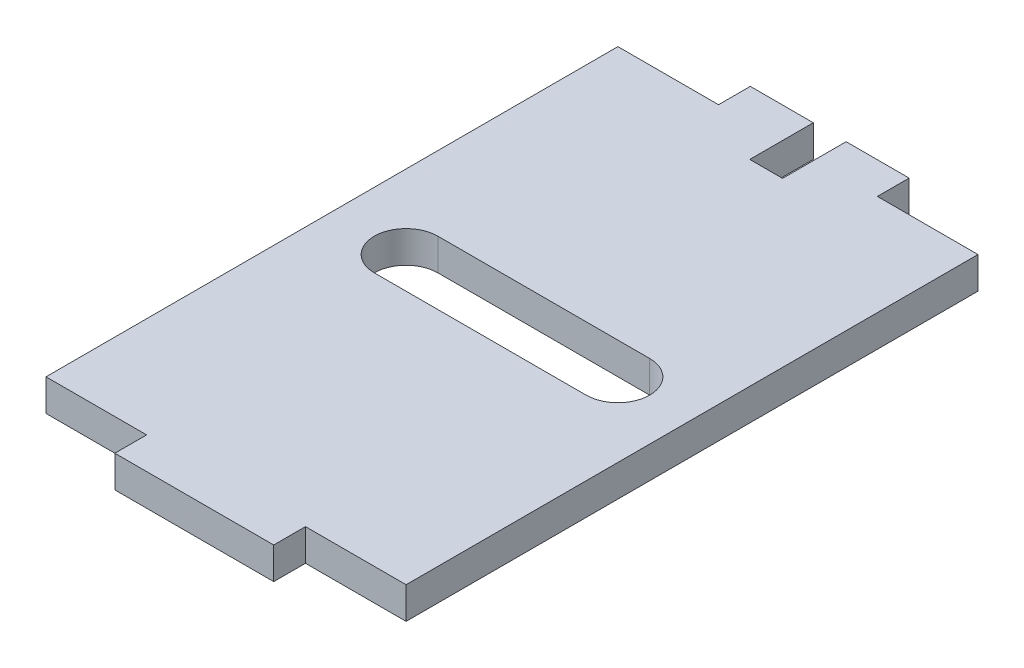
ISO-10303-21;
HEADER;
FILE_DESCRIPTION(('STEP AP214'),'2;1');
FILE_NAME('part.step','',(''),(''),'','','');
FILE_SCHEMA(('AUTOMOTIVE_DESIGN { 1 0 10303 214 1 1 1 1 }'));
ENDSEC;
DATA;
#1=APPLICATION_CONTEXT('core data for automotive mechanical design processes');
#2=APPLICATION_PROTOCOL_DEFINITION('international standard','automotive_design',2000,#1);
#3=PRODUCT_CONTEXT('',#1,'mechanical');
#4=PRODUCT('Part','Part','',(#3));
#5=PRODUCT_RELATED_PRODUCT_CATEGORY('part','',(#4));
#6=PRODUCT_DEFINITION_FORMATION('','',#4);
#7=PRODUCT_DEFINITION_CONTEXT('part definition',#1,'design');
#8=PRODUCT_DEFINITION('design','',#6,#7);
#9=PRODUCT_DEFINITION_SHAPE('','',#8);
#10=(LENGTH_UNIT() NAMED_UNIT(*) SI_UNIT(.MILLI.,.METRE.));
#11=(NAMED_UNIT(*) PLANE_ANGLE_UNIT() SI_UNIT($,.RADIAN.));
#12=(NAMED_UNIT(*) SI_UNIT($,.STERADIAN.) SOLID_ANGLE_UNIT());
#13=UNCERTAINTY_MEASURE_WITH_UNIT(LENGTH_MEASURE(1.E-05),#10,'distance_accuracy_value','');
#14=(GEOMETRIC_REPRESENTATION_CONTEXT(3) GLOBAL_UNCERTAINTY_ASSIGNED_CONTEXT((#13)) GLOBAL_UNIT_ASSIGNED_CONTEXT((#10,
#11,#12)) REPRESENTATION_CONTEXT('',''));
#15=CARTESIAN_POINT('',(0.,0.,0.));
#16=DIRECTION('',(0.,0.,1.));
#17=DIRECTION('',(1.,0.,0.));
#18=AXIS2_PLACEMENT_3D('',#15,#16,#17);
#19=CARTESIAN_POINT('',(17.,3.,27.));
#20=DIRECTION('',(0.,1.,0.));
#21=DIRECTION('',(0.,0.,1.));
#22=AXIS2_PLACEMENT_3D('',#19,#20,#21);
#23=PLANE('',#22);
#24=DIRECTION('',(1.,0.,0.));
#25=VECTOR('',#24,1.);
#26=CARTESIAN_POINT('',(-10.,3.,3.));
#27=LINE('',#26,#25);
#28=CARTESIAN_POINT('',(-10.,3.,3.));
#29=VERTEX_POINT('',#28);
#30=CARTESIAN_POINT('',(10.,3.,3.));
#31=VERTEX_POINT('',#30);
#32=EDGE_CURVE('E458',#29,#31,#27,.T.);
#33=ORIENTED_EDGE('',*,*,#32,.F.);
#34=CARTESIAN_POINT('',(-10.,3.,0.));
#35=DIRECTION('',(0.,1.,0.));
#36=DIRECTION('',(0.,0.,1.));
#37=AXIS2_PLACEMENT_3D('',#34,#35,#36);
#38=CIRCLE('',#37,3.);
#39=CARTESIAN_POINT('',(-10.,3.,-3.));
#40=VERTEX_POINT('',#39);
#41=EDGE_CURVE('E456',#40,#29,#38,.T.);
#42=ORIENTED_EDGE('',*,*,#41,.F.);
#43=DIRECTION('',(-1.,0.,0.));
#44=VECTOR('',#43,1.);
#45=CARTESIAN_POINT('',(-10.,3.,-3.));
#46=LINE('',#45,#44);
#47=CARTESIAN_POINT('',(10.,3.,-3.));
#48=VERTEX_POINT('',#47);
#49=EDGE_CURVE('E463',#48,#40,#46,.T.);
#50=ORIENTED_EDGE('',*,*,#49,.F.);
#51=CARTESIAN_POINT('',(10.,3.,0.));
#52=DIRECTION('',(0.,1.,0.));
#53=DIRECTION('',(0.,0.,1.));
#54=AXIS2_PLACEMENT_3D('',#51,#52,#53);
#55=CIRCLE('',#54,3.);
#56=EDGE_CURVE('E461',#31,#48,#55,.T.);
#57=ORIENTED_EDGE('',*,*,#56,.F.);
#58=EDGE_LOOP('',(#33,#42,#50,#57));
#59=FACE_BOUND('',#58,.T.);
#60=DIRECTION('',(-1.,0.,0.));
#61=VECTOR('',#60,1.);
#62=CARTESIAN_POINT('',(-7.50000000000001,3.,-30.));
#63=LINE('',#62,#61);
#64=CARTESIAN_POINT('',(7.49999999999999,3.,-30.));
#65=VERTEX_POINT('',#64);
#66=CARTESIAN_POINT('',(1.55,3.,-30.));
#67=VERTEX_POINT('',#66);
#68=EDGE_CURVE('E199',#65,#67,#63,.T.);
#69=ORIENTED_EDGE('',*,*,#68,.T.);
#70=DIRECTION('',(0.,0.,1.));
#71=VECTOR('',#70,1.);
#72=CARTESIAN_POINT('',(1.55,3.,27.));
#73=LINE('',#72,#71);
#74=CARTESIAN_POINT('',(1.55,3.,-24.));
#75=VERTEX_POINT('',#74);
#76=EDGE_CURVE('E175',#67,#75,#73,.T.);
#77=ORIENTED_EDGE('',*,*,#76,.T.);
#78=DIRECTION('',(-1.,0.,0.));
#79=VECTOR('',#78,1.);
#80=CARTESIAN_POINT('',(17.,3.,-24.));
#81=LINE('',#80,#79);
#82=CARTESIAN_POINT('',(-1.55,3.,-24.));
#83=VERTEX_POINT('',#82);
#84=EDGE_CURVE('E445',#75,#83,#81,.T.);
#85=ORIENTED_EDGE('',*,*,#84,.T.);
#86=DIRECTION('',(0.,0.,-1.));
#87=VECTOR('',#86,1.);
#88=CARTESIAN_POINT('',(-1.55,3.,27.));
#89=LINE('',#88,#87);
#90=CARTESIAN_POINT('',(-1.55,3.,-30.));
#91=VERTEX_POINT('',#90);
#92=EDGE_CURVE('E301',#83,#91,#89,.T.);
#93=ORIENTED_EDGE('',*,*,#92,.T.);
#94=CARTESIAN_POINT('',(-7.50000000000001,3.,-30.));
#95=VERTEX_POINT('',#94);
#96=EDGE_CURVE('E215',#91,#95,#63,.T.);
#97=ORIENTED_EDGE('',*,*,#96,.T.);
#98=DIRECTION('',(0.,0.,1.));
#99=VECTOR('',#98,1.);
#100=CARTESIAN_POINT('',(-7.50000000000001,3.,-30.));
#101=LINE('',#100,#99);
#102=CARTESIAN_POINT('',(-7.50000000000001,3.,-27.));
#103=VERTEX_POINT('',#102);
#104=EDGE_CURVE('E210',#95,#103,#101,.T.);
#105=ORIENTED_EDGE('',*,*,#104,.T.);
#106=DIRECTION('',(-1.,0.,0.));
#107=VECTOR('',#106,1.);
#108=CARTESIAN_POINT('',(-17.,3.,-27.));
#109=LINE('',#108,#107);
#110=CARTESIAN_POINT('',(-17.,3.,-27.));
#111=VERTEX_POINT('',#110);
#112=EDGE_CURVE('E278',#103,#111,#109,.T.);
#113=ORIENTED_EDGE('',*,*,#112,.T.);
#114=DIRECTION('',(0.,0.,1.));
#115=VECTOR('',#114,1.);
#116=CARTESIAN_POINT('',(-17.,3.,-27.));
#117=LINE('',#116,#115);
#118=CARTESIAN_POINT('',(-17.,3.,27.));
#119=VERTEX_POINT('',#118);
#120=EDGE_CURVE('E261',#111,#119,#117,.T.);
#121=ORIENTED_EDGE('',*,*,#120,.T.);
#122=DIRECTION('',(1.,0.,0.));
#123=VECTOR('',#122,1.);
#124=CARTESIAN_POINT('',(-17.,3.,27.));
#125=LINE('',#124,#123);
#126=CARTESIAN_POINT('',(-7.50000000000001,3.,27.));
#127=VERTEX_POINT('',#126);
#128=EDGE_CURVE('E239',#119,#127,#125,.T.);
#129=ORIENTED_EDGE('',*,*,#128,.T.);
#130=DIRECTION('',(0.,0.,1.));
#131=VECTOR('',#130,1.);
#132=CARTESIAN_POINT('',(-7.50000000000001,3.,30.));
#133=LINE('',#132,#131);
#134=CARTESIAN_POINT('',(-7.50000000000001,3.,30.));
#135=VERTEX_POINT('',#134);
#136=EDGE_CURVE('E330',#127,#135,#133,.T.);
#137=ORIENTED_EDGE('',*,*,#136,.T.);
#138=DIRECTION('',(1.,0.,0.));
#139=VECTOR('',#138,1.);
#140=CARTESIAN_POINT('',(-7.50000000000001,3.,30.));
#141=LINE('',#140,#139);
#142=CARTESIAN_POINT('',(7.49999999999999,3.,30.));
#143=VERTEX_POINT('',#142);
#144=EDGE_CURVE('E324',#135,#143,#141,.T.);
#145=ORIENTED_EDGE('',*,*,#144,.T.);
#146=DIRECTION('',(0.,0.,-1.));
#147=VECTOR('',#146,1.);
#148=CARTESIAN_POINT('',(7.49999999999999,3.,30.));
#149=LINE('',#148,#147);
#150=CARTESIAN_POINT('',(7.49999999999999,3.,27.));
#151=VERTEX_POINT('',#150);
#152=EDGE_CURVE('E320',#143,#151,#149,.T.);
#153=ORIENTED_EDGE('',*,*,#152,.T.);
#154=CARTESIAN_POINT('',(17.,3.,27.));
#155=VERTEX_POINT('',#154);
#156=EDGE_CURVE('E265',#151,#155,#125,.T.);
#157=ORIENTED_EDGE('',*,*,#156,.T.);
#158=DIRECTION('',(0.,0.,-1.));
#159=VECTOR('',#158,1.);
#160=CARTESIAN_POINT('',(17.,3.,-27.));
#161=LINE('',#160,#159);
#162=CARTESIAN_POINT('',(17.,3.,-27.));
#163=VERTEX_POINT('',#162);
#164=EDGE_CURVE('E226',#155,#163,#161,.T.);
#165=ORIENTED_EDGE('',*,*,#164,.T.);
#166=CARTESIAN_POINT('',(7.49999999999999,3.,-27.));
#167=VERTEX_POINT('',#166);
#168=EDGE_CURVE('E274',#163,#167,#109,.T.);
#169=ORIENTED_EDGE('',*,*,#168,.T.);
#170=DIRECTION('',(0.,0.,-1.));
#171=VECTOR('',#170,1.);
#172=CARTESIAN_POINT('',(7.49999999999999,3.,-30.));
#173=LINE('',#172,#171);
#174=EDGE_CURVE('E194',#167,#65,#173,.T.);
#175=ORIENTED_EDGE('',*,*,#174,.T.);
#176=EDGE_LOOP('',(#69,#77,#85,#93,#97,#105,#113,#121,#129,#137,#145,#153,#157,#165,#169,#175));
#177=FACE_BOUND('',#176,.T.);
#178=ADVANCED_FACE('F33',(#59,#177),#23,.T.);
#179=CARTESIAN_POINT('',(17.,0.,27.));
#180=DIRECTION('',(0.,1.,0.));
#181=DIRECTION('',(0.,0.,1.));
#182=AXIS2_PLACEMENT_3D('',#179,#180,#181);
#183=PLANE('',#182);
#184=CARTESIAN_POINT('',(-10.,0.,0.));
#185=DIRECTION('',(0.,1.,0.));
#186=DIRECTION('',(0.,0.,1.));
#187=AXIS2_PLACEMENT_3D('',#184,#185,#186);
#188=CIRCLE('',#187,3.);
#189=CARTESIAN_POINT('',(-10.,0.,-3.));
#190=VERTEX_POINT('',#189);
#191=CARTESIAN_POINT('',(-10.,0.,3.));
#192=VERTEX_POINT('',#191);
#193=EDGE_CURVE('E455',#190,#192,#188,.T.);
#194=ORIENTED_EDGE('',*,*,#193,.T.);
#195=DIRECTION('',(1.,0.,0.));
#196=VECTOR('',#195,1.);
#197=CARTESIAN_POINT('',(-10.,0.,3.));
#198=LINE('',#197,#196);
#199=CARTESIAN_POINT('',(10.,0.,3.));
#200=VERTEX_POINT('',#199);
#201=EDGE_CURVE('E468',#192,#200,#198,.T.);
#202=ORIENTED_EDGE('',*,*,#201,.T.);
#203=CARTESIAN_POINT('',(10.,0.,0.));
#204=DIRECTION('',(0.,1.,0.));
#205=DIRECTION('',(0.,0.,1.));
#206=AXIS2_PLACEMENT_3D('',#203,#204,#205);
#207=CIRCLE('',#206,3.);
#208=CARTESIAN_POINT('',(10.,0.,-3.));
#209=VERTEX_POINT('',#208);
#210=EDGE_CURVE('E471',#200,#209,#207,.T.);
#211=ORIENTED_EDGE('',*,*,#210,.T.);
#212=DIRECTION('',(-1.,0.,0.));
#213=VECTOR('',#212,1.);
#214=CARTESIAN_POINT('',(-10.,0.,-3.));
#215=LINE('',#214,#213);
#216=EDGE_CURVE('E459',#209,#190,#215,.T.);
#217=ORIENTED_EDGE('',*,*,#216,.T.);
#218=EDGE_LOOP('',(#194,#202,#211,#217));
#219=FACE_BOUND('',#218,.T.);
#220=DIRECTION('',(0.,0.,-1.));
#221=VECTOR('',#220,1.);
#222=CARTESIAN_POINT('',(1.55,0.,-24.));
#223=LINE('',#222,#221);
#224=CARTESIAN_POINT('',(1.55,0.,-24.));
#225=VERTEX_POINT('',#224);
#226=CARTESIAN_POINT('',(1.55,0.,-30.));
#227=VERTEX_POINT('',#226);
#228=EDGE_CURVE('E172',#225,#227,#223,.T.);
#229=ORIENTED_EDGE('',*,*,#228,.T.);
#230=DIRECTION('',(-1.,0.,0.));
#231=VECTOR('',#230,1.);
#232=CARTESIAN_POINT('',(-7.50000000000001,0.,-30.));
#233=LINE('',#232,#231);
#234=CARTESIAN_POINT('',(7.49999999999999,0.,-30.));
#235=VERTEX_POINT('',#234);
#236=EDGE_CURVE('E182',#235,#227,#233,.T.);
#237=ORIENTED_EDGE('',*,*,#236,.F.);
#238=DIRECTION('',(0.,0.,-1.));
#239=VECTOR('',#238,1.);
#240=CARTESIAN_POINT('',(7.49999999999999,0.,-30.));
#241=LINE('',#240,#239);
#242=CARTESIAN_POINT('',(7.49999999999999,0.,-27.));
#243=VERTEX_POINT('',#242);
#244=EDGE_CURVE('E196',#243,#235,#241,.T.);
#245=ORIENTED_EDGE('',*,*,#244,.F.);
#246=DIRECTION('',(-1.,0.,0.));
#247=VECTOR('',#246,1.);
#248=CARTESIAN_POINT('',(-17.,0.,-27.));
#249=LINE('',#248,#247);
#250=CARTESIAN_POINT('',(17.,0.,-27.));
#251=VERTEX_POINT('',#250);
#252=EDGE_CURVE('E248',#251,#243,#249,.T.);
#253=ORIENTED_EDGE('',*,*,#252,.F.);
#254=DIRECTION('',(0.,0.,-1.));
#255=VECTOR('',#254,1.);
#256=CARTESIAN_POINT('',(17.,0.,-27.));
#257=LINE('',#256,#255);
#258=CARTESIAN_POINT('',(17.,0.,27.));
#259=VERTEX_POINT('',#258);
#260=EDGE_CURVE('E255',#259,#251,#257,.T.);
#261=ORIENTED_EDGE('',*,*,#260,.F.);
#262=DIRECTION('',(1.,0.,0.));
#263=VECTOR('',#262,1.);
#264=CARTESIAN_POINT('',(-17.,0.,27.));
#265=LINE('',#264,#263);
#266=CARTESIAN_POINT('',(7.49999999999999,0.,27.));
#267=VERTEX_POINT('',#266);
#268=EDGE_CURVE('E227',#267,#259,#265,.T.);
#269=ORIENTED_EDGE('',*,*,#268,.F.);
#270=DIRECTION('',(0.,0.,-1.));
#271=VECTOR('',#270,1.);
#272=CARTESIAN_POINT('',(7.49999999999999,0.,30.));
#273=LINE('',#272,#271);
#274=CARTESIAN_POINT('',(7.49999999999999,0.,30.));
#275=VERTEX_POINT('',#274);
#276=EDGE_CURVE('E340',#275,#267,#273,.T.);
#277=ORIENTED_EDGE('',*,*,#276,.F.);
#278=DIRECTION('',(1.,0.,0.));
#279=VECTOR('',#278,1.);
#280=CARTESIAN_POINT('',(-7.50000000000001,0.,30.));
#281=LINE('',#280,#279);
#282=CARTESIAN_POINT('',(-7.50000000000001,0.,30.));
#283=VERTEX_POINT('',#282);
#284=EDGE_CURVE('E335',#283,#275,#281,.T.);
#285=ORIENTED_EDGE('',*,*,#284,.F.);
#286=DIRECTION('',(0.,0.,1.));
#287=VECTOR('',#286,1.);
#288=CARTESIAN_POINT('',(-7.50000000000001,0.,30.));
#289=LINE('',#288,#287);
#290=CARTESIAN_POINT('',(-7.50000000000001,0.,27.));
#291=VERTEX_POINT('',#290);
#292=EDGE_CURVE('E347',#291,#283,#289,.T.);
#293=ORIENTED_EDGE('',*,*,#292,.F.);
#294=CARTESIAN_POINT('',(-17.,0.,27.));
#295=VERTEX_POINT('',#294);
#296=EDGE_CURVE('E222',#295,#291,#265,.T.);
#297=ORIENTED_EDGE('',*,*,#296,.F.);
#298=DIRECTION('',(0.,0.,1.));
#299=VECTOR('',#298,1.);
#300=CARTESIAN_POINT('',(-17.,0.,-27.));
#301=LINE('',#300,#299);
#302=CARTESIAN_POINT('',(-17.,0.,-27.));
#303=VERTEX_POINT('',#302);
#304=EDGE_CURVE('E232',#303,#295,#301,.T.);
#305=ORIENTED_EDGE('',*,*,#304,.F.);
#306=CARTESIAN_POINT('',(-7.50000000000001,0.,-27.));
#307=VERTEX_POINT('',#306);
#308=EDGE_CURVE('E251',#307,#303,#249,.T.);
#309=ORIENTED_EDGE('',*,*,#308,.F.);
#310=DIRECTION('',(0.,0.,1.));
#311=VECTOR('',#310,1.);
#312=CARTESIAN_POINT('',(-7.50000000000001,0.,-30.));
#313=LINE('',#312,#311);
#314=CARTESIAN_POINT('',(-7.50000000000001,0.,-30.));
#315=VERTEX_POINT('',#314);
#316=EDGE_CURVE('E191',#315,#307,#313,.T.);
#317=ORIENTED_EDGE('',*,*,#316,.F.);
#318=CARTESIAN_POINT('',(-1.55,0.,-30.));
#319=VERTEX_POINT('',#318);
#320=EDGE_CURVE('E192',#319,#315,#233,.T.);
#321=ORIENTED_EDGE('',*,*,#320,.F.);
#322=DIRECTION('',(0.,0.,1.));
#323=VECTOR('',#322,1.);
#324=CARTESIAN_POINT('',(-1.55,0.,-24.));
#325=LINE('',#324,#323);
#326=CARTESIAN_POINT('',(-1.55,0.,-24.));
#327=VERTEX_POINT('',#326);
#328=EDGE_CURVE('E48',#319,#327,#325,.T.);
#329=ORIENTED_EDGE('',*,*,#328,.T.);
#330=DIRECTION('',(1.,0.,0.));
#331=VECTOR('',#330,1.);
#332=CARTESIAN_POINT('',(-1.55,0.,-24.));
#333=LINE('',#332,#331);
#334=EDGE_CURVE('E185',#327,#225,#333,.T.);
#335=ORIENTED_EDGE('',*,*,#334,.T.);
#336=EDGE_LOOP('',(#229,#237,#245,#253,#261,#269,#277,#285,#293,#297,#305,#309,#317,#321,#329,#335));
#337=FACE_BOUND('',#336,.T.);
#338=ADVANCED_FACE('F180',(#219,#337),#183,.F.);
#339=CARTESIAN_POINT('',(-7.50000000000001,3.,-30.));
#340=DIRECTION('',(0.,0.,1.));
#341=DIRECTION('',(1.,0.,0.));
#342=AXIS2_PLACEMENT_3D('',#339,#340,#341);
#343=PLANE('',#342);
#344=DIRECTION('',(0.,-1.,0.));
#345=VECTOR('',#344,1.);
#346=CARTESIAN_POINT('',(1.55,3.,-30.));
#347=LINE('',#346,#345);
#348=EDGE_CURVE('E11',#67,#227,#347,.T.);
#349=ORIENTED_EDGE('',*,*,#348,.F.);
#350=ORIENTED_EDGE('',*,*,#68,.F.);
#351=DIRECTION('',(0.,-1.,0.));
#352=VECTOR('',#351,1.);
#353=CARTESIAN_POINT('',(7.49999999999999,3.,-30.));
#354=LINE('',#353,#352);
#355=EDGE_CURVE('E189',#65,#235,#354,.T.);
#356=ORIENTED_EDGE('',*,*,#355,.T.);
#357=ORIENTED_EDGE('',*,*,#236,.T.);
#358=EDGE_LOOP('',(#349,#350,#356,#357));
#359=FACE_BOUND('',#358,.T.);
#360=ADVANCED_FACE('F187',(#359),#343,.F.);
#361=DIRECTION('',(0.,1.,0.));
#362=VECTOR('',#361,1.);
#363=CARTESIAN_POINT('',(-1.55,3.,-30.));
#364=LINE('',#363,#362);
#365=EDGE_CURVE('E41',#319,#91,#364,.T.);
#366=ORIENTED_EDGE('',*,*,#365,.F.);
#367=ORIENTED_EDGE('',*,*,#320,.T.);
#368=DIRECTION('',(0.,-1.,0.));
#369=VECTOR('',#368,1.);
#370=CARTESIAN_POINT('',(-7.50000000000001,3.,-30.));
#371=LINE('',#370,#369);
#372=EDGE_CURVE('E285',#95,#315,#371,.T.);
#373=ORIENTED_EDGE('',*,*,#372,.F.);
#374=ORIENTED_EDGE('',*,*,#96,.F.);
#375=EDGE_LOOP('',(#366,#367,#373,#374));
#376=FACE_BOUND('',#375,.T.);
#377=ADVANCED_FACE('F303',(#376),#343,.F.);
#378=CARTESIAN_POINT('',(-17.,3.,27.));
#379=DIRECTION('',(0.,0.,-1.));
#380=DIRECTION('',(-1.,0.,0.));
#381=AXIS2_PLACEMENT_3D('',#378,#379,#380);
#382=PLANE('',#381);
#383=DIRECTION('',(0.,-1.,0.));
#384=VECTOR('',#383,1.);
#385=CARTESIAN_POINT('',(-7.50000000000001,3.,27.));
#386=LINE('',#385,#384);
#387=EDGE_CURVE('E315',#127,#291,#386,.T.);
#388=ORIENTED_EDGE('',*,*,#387,.F.);
#389=ORIENTED_EDGE('',*,*,#128,.F.);
#390=DIRECTION('',(0.,-1.,0.));
#391=VECTOR('',#390,1.);
#392=CARTESIAN_POINT('',(-17.,3.,27.));
#393=LINE('',#392,#391);
#394=EDGE_CURVE('E238',#119,#295,#393,.T.);
#395=ORIENTED_EDGE('',*,*,#394,.T.);
#396=ORIENTED_EDGE('',*,*,#296,.T.);
#397=EDGE_LOOP('',(#388,#389,#395,#396));
#398=FACE_BOUND('',#397,.T.);
#399=ADVANCED_FACE('F314',(#398),#382,.F.);
#400=CARTESIAN_POINT('',(-17.,3.,-27.));
#401=DIRECTION('',(0.,0.,1.));
#402=DIRECTION('',(1.,0.,0.));
#403=AXIS2_PLACEMENT_3D('',#400,#401,#402);
#404=PLANE('',#403);
#405=DIRECTION('',(0.,-1.,0.));
#406=VECTOR('',#405,1.);
#407=CARTESIAN_POINT('',(7.49999999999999,3.,-27.));
#408=LINE('',#407,#406);
#409=EDGE_CURVE('E206',#167,#243,#408,.T.);
#410=ORIENTED_EDGE('',*,*,#409,.F.);
#411=ORIENTED_EDGE('',*,*,#168,.F.);
#412=DIRECTION('',(0.,-1.,0.));
#413=VECTOR('',#412,1.);
#414=CARTESIAN_POINT('',(17.,3.,-27.));
#415=LINE('',#414,#413);
#416=EDGE_CURVE('E245',#163,#251,#415,.T.);
#417=ORIENTED_EDGE('',*,*,#416,.T.);
#418=ORIENTED_EDGE('',*,*,#252,.T.);
#419=EDGE_LOOP('',(#410,#411,#417,#418));
#420=FACE_BOUND('',#419,.T.);
#421=ADVANCED_FACE('F371',(#420),#404,.F.);
#422=CARTESIAN_POINT('',(17.,3.,-27.));
#423=DIRECTION('',(-1.,0.,0.));
#424=DIRECTION('',(0.,0.,1.));
#425=AXIS2_PLACEMENT_3D('',#422,#423,#424);
#426=PLANE('',#425);
#427=ORIENTED_EDGE('',*,*,#260,.T.);
#428=ORIENTED_EDGE('',*,*,#416,.F.);
#429=ORIENTED_EDGE('',*,*,#164,.F.);
#430=DIRECTION('',(0.,-1.,0.));
#431=VECTOR('',#430,1.);
#432=CARTESIAN_POINT('',(17.,3.,27.));
#433=LINE('',#432,#431);
#434=EDGE_CURVE('E234',#155,#259,#433,.T.);
#435=ORIENTED_EDGE('',*,*,#434,.T.);
#436=EDGE_LOOP('',(#427,#428,#429,#435));
#437=FACE_BOUND('',#436,.T.);
#438=ADVANCED_FACE('F35',(#437),#426,.F.);
#439=ORIENTED_EDGE('',*,*,#112,.F.);
#440=DIRECTION('',(0.,-1.,0.));
#441=VECTOR('',#440,1.);
#442=CARTESIAN_POINT('',(-7.50000000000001,3.,-27.));
#443=LINE('',#442,#441);
#444=EDGE_CURVE('E209',#103,#307,#443,.T.);
#445=ORIENTED_EDGE('',*,*,#444,.T.);
#446=ORIENTED_EDGE('',*,*,#308,.T.);
#447=DIRECTION('',(0.,-1.,0.));
#448=VECTOR('',#447,1.);
#449=CARTESIAN_POINT('',(-17.,3.,-27.));
#450=LINE('',#449,#448);
#451=EDGE_CURVE('E242',#111,#303,#450,.T.);
#452=ORIENTED_EDGE('',*,*,#451,.F.);
#453=EDGE_LOOP('',(#439,#445,#446,#452));
#454=FACE_BOUND('',#453,.T.);
#455=ADVANCED_FACE('F307',(#454),#404,.F.);
#456=CARTESIAN_POINT('',(-17.,3.,-27.));
#457=DIRECTION('',(1.,0.,0.));
#458=DIRECTION('',(0.,0.,-1.));
#459=AXIS2_PLACEMENT_3D('',#456,#457,#458);
#460=PLANE('',#459);
#461=ORIENTED_EDGE('',*,*,#304,.T.);
#462=ORIENTED_EDGE('',*,*,#394,.F.);
#463=ORIENTED_EDGE('',*,*,#120,.F.);
#464=ORIENTED_EDGE('',*,*,#451,.T.);
#465=EDGE_LOOP('',(#461,#462,#463,#464));
#466=FACE_BOUND('',#465,.T.);
#467=ADVANCED_FACE('F310',(#466),#460,.F.);
#468=ORIENTED_EDGE('',*,*,#156,.F.);
#469=DIRECTION('',(0.,-1.,0.));
#470=VECTOR('',#469,1.);
#471=CARTESIAN_POINT('',(7.49999999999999,3.,27.));
#472=LINE('',#471,#470);
#473=EDGE_CURVE('E319',#151,#267,#472,.T.);
#474=ORIENTED_EDGE('',*,*,#473,.T.);
#475=ORIENTED_EDGE('',*,*,#268,.T.);
#476=ORIENTED_EDGE('',*,*,#434,.F.);
#477=EDGE_LOOP('',(#468,#474,#475,#476));
#478=FACE_BOUND('',#477,.T.);
#479=ADVANCED_FACE('F364',(#478),#382,.F.);
#480=CARTESIAN_POINT('',(7.49999999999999,3.,-30.));
#481=DIRECTION('',(-1.,0.,0.));
#482=DIRECTION('',(0.,0.,1.));
#483=AXIS2_PLACEMENT_3D('',#480,#481,#482);
#484=PLANE('',#483);
#485=ORIENTED_EDGE('',*,*,#244,.T.);
#486=ORIENTED_EDGE('',*,*,#355,.F.);
#487=ORIENTED_EDGE('',*,*,#174,.F.);
#488=ORIENTED_EDGE('',*,*,#409,.T.);
#489=EDGE_LOOP('',(#485,#486,#487,#488));
#490=FACE_BOUND('',#489,.T.);
#491=ADVANCED_FACE('F373',(#490),#484,.F.);
#492=CARTESIAN_POINT('',(-7.50000000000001,3.,-30.));
#493=DIRECTION('',(1.,0.,0.));
#494=DIRECTION('',(0.,0.,-1.));
#495=AXIS2_PLACEMENT_3D('',#492,#493,#494);
#496=PLANE('',#495);
#497=ORIENTED_EDGE('',*,*,#316,.T.);
#498=ORIENTED_EDGE('',*,*,#444,.F.);
#499=ORIENTED_EDGE('',*,*,#104,.F.);
#500=ORIENTED_EDGE('',*,*,#372,.T.);
#501=EDGE_LOOP('',(#497,#498,#499,#500));
#502=FACE_BOUND('',#501,.T.);
#503=ADVANCED_FACE('F305',(#502),#496,.F.);
#504=CARTESIAN_POINT('',(-7.50000000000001,3.,30.));
#505=DIRECTION('',(1.,0.,0.));
#506=DIRECTION('',(0.,0.,-1.));
#507=AXIS2_PLACEMENT_3D('',#504,#505,#506);
#508=PLANE('',#507);
#509=ORIENTED_EDGE('',*,*,#292,.T.);
#510=DIRECTION('',(0.,-1.,0.));
#511=VECTOR('',#510,1.);
#512=CARTESIAN_POINT('',(-7.50000000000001,3.,30.));
#513=LINE('',#512,#511);
#514=EDGE_CURVE('E219',#135,#283,#513,.T.);
#515=ORIENTED_EDGE('',*,*,#514,.F.);
#516=ORIENTED_EDGE('',*,*,#136,.F.);
#517=ORIENTED_EDGE('',*,*,#387,.T.);
#518=EDGE_LOOP('',(#509,#515,#516,#517));
#519=FACE_BOUND('',#518,.T.);
#520=ADVANCED_FACE('F380',(#519),#508,.F.);
#521=CARTESIAN_POINT('',(-7.50000000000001,3.,30.));
#522=DIRECTION('',(0.,0.,-1.));
#523=DIRECTION('',(-1.,0.,0.));
#524=AXIS2_PLACEMENT_3D('',#521,#522,#523);
#525=PLANE('',#524);
#526=ORIENTED_EDGE('',*,*,#284,.T.);
#527=DIRECTION('',(0.,-1.,0.));
#528=VECTOR('',#527,1.);
#529=CARTESIAN_POINT('',(7.49999999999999,3.,30.));
#530=LINE('',#529,#528);
#531=EDGE_CURVE('E323',#143,#275,#530,.T.);
#532=ORIENTED_EDGE('',*,*,#531,.F.);
#533=ORIENTED_EDGE('',*,*,#144,.F.);
#534=ORIENTED_EDGE('',*,*,#514,.T.);
#535=EDGE_LOOP('',(#526,#532,#533,#534));
#536=FACE_BOUND('',#535,.T.);
#537=ADVANCED_FACE('F414',(#536),#525,.F.);
#538=CARTESIAN_POINT('',(7.49999999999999,3.,30.));
#539=DIRECTION('',(-1.,0.,0.));
#540=DIRECTION('',(0.,0.,1.));
#541=AXIS2_PLACEMENT_3D('',#538,#539,#540);
#542=PLANE('',#541);
#543=ORIENTED_EDGE('',*,*,#276,.T.);
#544=ORIENTED_EDGE('',*,*,#473,.F.);
#545=ORIENTED_EDGE('',*,*,#152,.F.);
#546=ORIENTED_EDGE('',*,*,#531,.T.);
#547=EDGE_LOOP('',(#543,#544,#545,#546));
#548=FACE_BOUND('',#547,.T.);
#549=ADVANCED_FACE('F417',(#548),#542,.F.);
#550=CARTESIAN_POINT('',(-10.,3.,0.));
#551=DIRECTION('',(0.,-1.,0.));
#552=DIRECTION('',(0.,0.,-1.));
#553=AXIS2_PLACEMENT_3D('',#550,#551,#552);
#554=CYLINDRICAL_SURFACE('',#553,3.);
#555=ORIENTED_EDGE('',*,*,#193,.F.);
#556=DIRECTION('',(0.,-1.,0.));
#557=VECTOR('',#556,1.);
#558=CARTESIAN_POINT('',(-10.,3.,-3.));
#559=LINE('',#558,#557);
#560=EDGE_CURVE('E465',#40,#190,#559,.T.);
#561=ORIENTED_EDGE('',*,*,#560,.F.);
#562=ORIENTED_EDGE('',*,*,#41,.T.);
#563=DIRECTION('',(0.,-1.,0.));
#564=VECTOR('',#563,1.);
#565=CARTESIAN_POINT('',(-10.,3.,3.));
#566=LINE('',#565,#564);
#567=EDGE_CURVE('E351',#29,#192,#566,.T.);
#568=ORIENTED_EDGE('',*,*,#567,.T.);
#569=EDGE_LOOP('',(#555,#561,#562,#568));
#570=FACE_BOUND('',#569,.T.);
#571=ADVANCED_FACE('F420',(#570),#554,.F.);
#572=CARTESIAN_POINT('',(-10.,3.,3.));
#573=DIRECTION('',(0.,0.,-1.));
#574=DIRECTION('',(-1.,0.,0.));
#575=AXIS2_PLACEMENT_3D('',#572,#573,#574);
#576=PLANE('',#575);
#577=ORIENTED_EDGE('',*,*,#201,.F.);
#578=ORIENTED_EDGE('',*,*,#567,.F.);
#579=ORIENTED_EDGE('',*,*,#32,.T.);
#580=DIRECTION('',(0.,-1.,0.));
#581=VECTOR('',#580,1.);
#582=CARTESIAN_POINT('',(10.,3.,3.));
#583=LINE('',#582,#581);
#584=EDGE_CURVE('E355',#31,#200,#583,.T.);
#585=ORIENTED_EDGE('',*,*,#584,.T.);
#586=EDGE_LOOP('',(#577,#578,#579,#585));
#587=FACE_BOUND('',#586,.T.);
#588=ADVANCED_FACE('F423',(#587),#576,.T.);
#589=CARTESIAN_POINT('',(10.,3.,0.));
#590=DIRECTION('',(0.,-1.,0.));
#591=DIRECTION('',(0.,0.,-1.));
#592=AXIS2_PLACEMENT_3D('',#589,#590,#591);
#593=CYLINDRICAL_SURFACE('',#592,3.);
#594=ORIENTED_EDGE('',*,*,#210,.F.);
#595=ORIENTED_EDGE('',*,*,#584,.F.);
#596=ORIENTED_EDGE('',*,*,#56,.T.);
#597=DIRECTION('',(0.,-1.,0.));
#598=VECTOR('',#597,1.);
#599=CARTESIAN_POINT('',(10.,3.,-3.));
#600=LINE('',#599,#598);
#601=EDGE_CURVE('E56',#48,#209,#600,.T.);
#602=ORIENTED_EDGE('',*,*,#601,.T.);
#603=EDGE_LOOP('',(#594,#595,#596,#602));
#604=FACE_BOUND('',#603,.T.);
#605=ADVANCED_FACE('F427',(#604),#593,.F.);
#606=CARTESIAN_POINT('',(-10.,3.,-3.));
#607=DIRECTION('',(0.,0.,1.));
#608=DIRECTION('',(1.,0.,0.));
#609=AXIS2_PLACEMENT_3D('',#606,#607,#608);
#610=PLANE('',#609);
#611=ORIENTED_EDGE('',*,*,#216,.F.);
#612=ORIENTED_EDGE('',*,*,#601,.F.);
#613=ORIENTED_EDGE('',*,*,#49,.T.);
#614=ORIENTED_EDGE('',*,*,#560,.T.);
#615=EDGE_LOOP('',(#611,#612,#613,#614));
#616=FACE_BOUND('',#615,.T.);
#617=ADVANCED_FACE('F431',(#616),#610,.T.);
#618=CARTESIAN_POINT('',(1.55,10.,-24.));
#619=DIRECTION('',(-1.,0.,0.));
#620=DIRECTION('',(0.,0.,1.));
#621=AXIS2_PLACEMENT_3D('',#618,#619,#620);
#622=PLANE('',#621);
#623=ORIENTED_EDGE('',*,*,#348,.T.);
#624=ORIENTED_EDGE('',*,*,#228,.F.);
#625=DIRECTION('',(0.,-1.,0.));
#626=VECTOR('',#625,1.);
#627=CARTESIAN_POINT('',(1.55,10.,-24.));
#628=LINE('',#627,#626);
#629=EDGE_CURVE('E444',#75,#225,#628,.T.);
#630=ORIENTED_EDGE('',*,*,#629,.F.);
#631=ORIENTED_EDGE('',*,*,#76,.F.);
#632=EDGE_LOOP('',(#623,#624,#630,#631));
#633=FACE_BOUND('',#632,.T.);
#634=ADVANCED_FACE('F170',(#633),#622,.T.);
#635=CARTESIAN_POINT('',(-1.55,10.,-24.));
#636=DIRECTION('',(1.,0.,0.));
#637=DIRECTION('',(0.,0.,-1.));
#638=AXIS2_PLACEMENT_3D('',#635,#636,#637);
#639=PLANE('',#638);
#640=DIRECTION('',(0.,-1.,0.));
#641=VECTOR('',#640,1.);
#642=CARTESIAN_POINT('',(-1.55,10.,-24.));
#643=LINE('',#642,#641);
#644=EDGE_CURVE('E446',#83,#327,#643,.T.);
#645=ORIENTED_EDGE('',*,*,#644,.T.);
#646=ORIENTED_EDGE('',*,*,#328,.F.);
#647=ORIENTED_EDGE('',*,*,#365,.T.);
#648=ORIENTED_EDGE('',*,*,#92,.F.);
#649=EDGE_LOOP('',(#645,#646,#647,#648));
#650=FACE_BOUND('',#649,.T.);
#651=ADVANCED_FACE('F360',(#650),#639,.T.);
#652=CARTESIAN_POINT('',(-1.55,10.,-24.));
#653=DIRECTION('',(0.,0.,-1.));
#654=DIRECTION('',(-1.,0.,0.));
#655=AXIS2_PLACEMENT_3D('',#652,#653,#654);
#656=PLANE('',#655);
#657=ORIENTED_EDGE('',*,*,#629,.T.);
#658=ORIENTED_EDGE('',*,*,#334,.F.);
#659=ORIENTED_EDGE('',*,*,#644,.F.);
#660=ORIENTED_EDGE('',*,*,#84,.F.);
#661=EDGE_LOOP('',(#657,#658,#659,#660));
#662=FACE_BOUND('',#661,.T.);
#663=ADVANCED_FACE('F439',(#662),#656,.T.);
#664=CLOSED_SHELL('',(#178,#338,#360,#377,#399,#421,#438,#455,#467,#479,#491,#503,#520,#537,
#549,#571,#588,#605,#617,#634,#651,#663));
#665=MANIFOLD_SOLID_BREP('B2',#664);
#666=ADVANCED_BREP_SHAPE_REPRESENTATION('',(#18,#665),#14);
#667=SHAPE_DEFINITION_REPRESENTATION(#9,#666);
ENDSEC;
END-ISO-10303-21;
